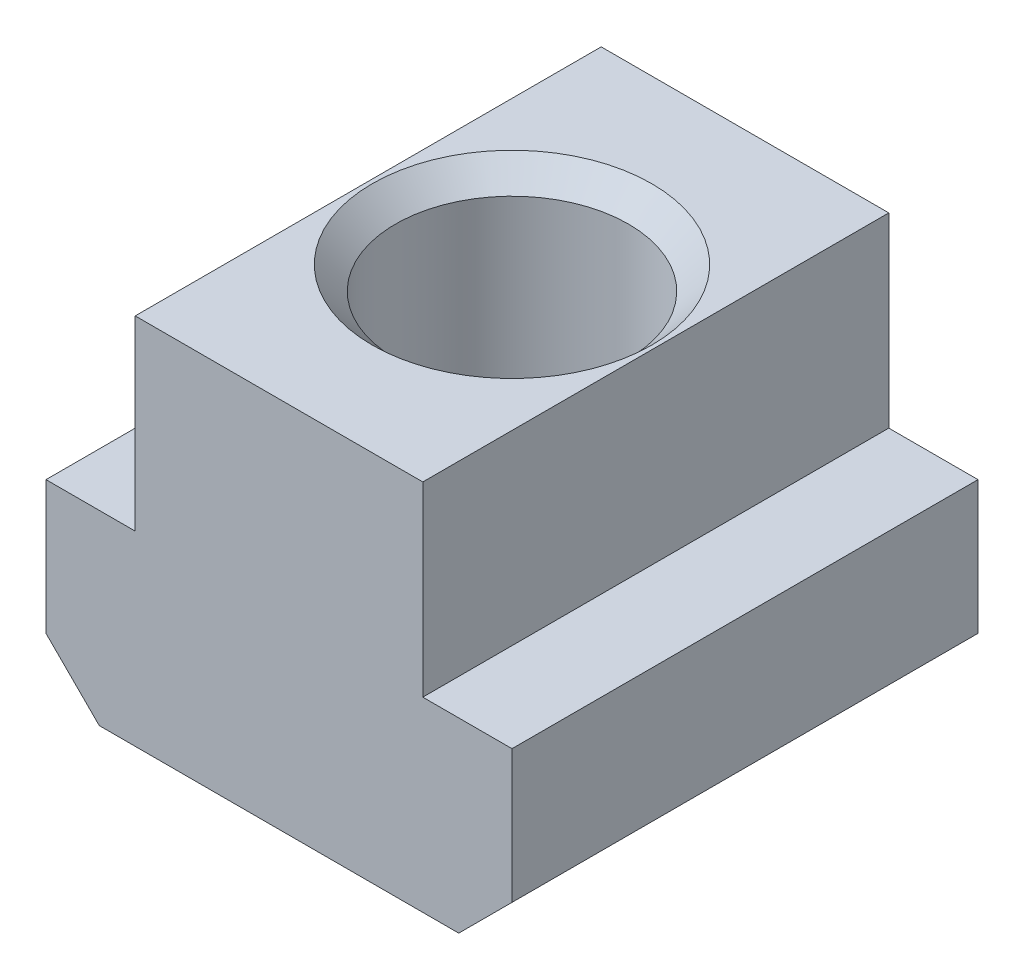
ISO-10303-21;
HEADER;
FILE_DESCRIPTION(('STEP AP214'),'2;1');
FILE_NAME('part.step','',(''),(''),'','','');
FILE_SCHEMA(('AUTOMOTIVE_DESIGN { 1 0 10303 214 1 1 1 1 }'));
ENDSEC;
DATA;
#1=APPLICATION_CONTEXT('core data for automotive mechanical design processes');
#2=APPLICATION_PROTOCOL_DEFINITION('international standard','automotive_design',2000,#1);
#3=PRODUCT_CONTEXT('',#1,'mechanical');
#4=PRODUCT('Part','Part','',(#3));
#5=PRODUCT_RELATED_PRODUCT_CATEGORY('part','',(#4));
#6=PRODUCT_DEFINITION_FORMATION('','',#4);
#7=PRODUCT_DEFINITION_CONTEXT('part definition',#1,'design');
#8=PRODUCT_DEFINITION('design','',#6,#7);
#9=PRODUCT_DEFINITION_SHAPE('','',#8);
#10=(LENGTH_UNIT() NAMED_UNIT(*) SI_UNIT(.MILLI.,.METRE.));
#11=(NAMED_UNIT(*) PLANE_ANGLE_UNIT() SI_UNIT($,.RADIAN.));
#12=(NAMED_UNIT(*) SI_UNIT($,.STERADIAN.) SOLID_ANGLE_UNIT());
#13=UNCERTAINTY_MEASURE_WITH_UNIT(LENGTH_MEASURE(1.E-05),#10,'distance_accuracy_value','');
#14=(GEOMETRIC_REPRESENTATION_CONTEXT(3) GLOBAL_UNCERTAINTY_ASSIGNED_CONTEXT((#13)) GLOBAL_UNIT_ASSIGNED_CONTEXT((#10,
#11,#12)) REPRESENTATION_CONTEXT('',''));
#15=CARTESIAN_POINT('',(0.,0.,0.));
#16=DIRECTION('',(0.,0.,1.));
#17=DIRECTION('',(1.,0.,0.));
#18=AXIS2_PLACEMENT_3D('',#15,#16,#17);
#19=CARTESIAN_POINT('',(17.5,0.,17.5));
#20=DIRECTION('',(-1.,0.,0.));
#21=DIRECTION('',(0.,0.,1.));
#22=AXIS2_PLACEMENT_3D('',#19,#20,#21);
#23=PLANE('',#22);
#24=DIRECTION('',(0.,1.,0.));
#25=VECTOR('',#24,1.);
#26=CARTESIAN_POINT('',(17.5,0.,17.5));
#27=LINE('',#26,#25);
#28=CARTESIAN_POINT('',(17.5,-9.99999999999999,17.5));
#29=VERTEX_POINT('',#28);
#30=CARTESIAN_POINT('',(17.5,0.,17.5));
#31=VERTEX_POINT('',#30);
#32=EDGE_CURVE('E114',#29,#31,#27,.T.);
#33=ORIENTED_EDGE('',*,*,#32,.F.);
#34=DIRECTION('',(0.,0.,-1.));
#35=VECTOR('',#34,1.);
#36=CARTESIAN_POINT('',(17.5,-10.,17.5));
#37=LINE('',#36,#35);
#38=CARTESIAN_POINT('',(17.5,-9.99999999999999,-17.5));
#39=VERTEX_POINT('',#38);
#40=EDGE_CURVE('E11',#29,#39,#37,.T.);
#41=ORIENTED_EDGE('',*,*,#40,.T.);
#42=DIRECTION('',(0.,1.,0.));
#43=VECTOR('',#42,1.);
#44=CARTESIAN_POINT('',(17.5,0.,-17.5));
#45=LINE('',#44,#43);
#46=CARTESIAN_POINT('',(17.5,0.,-17.5));
#47=VERTEX_POINT('',#46);
#48=EDGE_CURVE('E134',#39,#47,#45,.T.);
#49=ORIENTED_EDGE('',*,*,#48,.T.);
#50=DIRECTION('',(0.,0.,-1.));
#51=VECTOR('',#50,1.);
#52=CARTESIAN_POINT('',(17.5,0.,17.5));
#53=LINE('',#52,#51);
#54=EDGE_CURVE('E127',#31,#47,#53,.T.);
#55=ORIENTED_EDGE('',*,*,#54,.F.);
#56=EDGE_LOOP('',(#33,#41,#49,#55));
#57=FACE_BOUND('',#56,.T.);
#58=ADVANCED_FACE('F37',(#57),#23,.F.);
#59=CARTESIAN_POINT('',(10.8,0.,17.5));
#60=DIRECTION('',(0.,-1.,0.));
#61=DIRECTION('',(0.,0.,-1.));
#62=AXIS2_PLACEMENT_3D('',#59,#60,#61);
#63=PLANE('',#62);
#64=DIRECTION('',(-1.,0.,0.));
#65=VECTOR('',#64,1.);
#66=CARTESIAN_POINT('',(10.8,0.,-17.5));
#67=LINE('',#66,#65);
#68=CARTESIAN_POINT('',(10.8,0.,-17.5));
#69=VERTEX_POINT('',#68);
#70=EDGE_CURVE('E200',#47,#69,#67,.T.);
#71=ORIENTED_EDGE('',*,*,#70,.T.);
#72=DIRECTION('',(0.,0.,-1.));
#73=VECTOR('',#72,1.);
#74=CARTESIAN_POINT('',(10.8,0.,17.5));
#75=LINE('',#74,#73);
#76=CARTESIAN_POINT('',(10.8,0.,17.5));
#77=VERTEX_POINT('',#76);
#78=EDGE_CURVE('E129',#77,#69,#75,.T.);
#79=ORIENTED_EDGE('',*,*,#78,.F.);
#80=DIRECTION('',(-1.,0.,0.));
#81=VECTOR('',#80,1.);
#82=CARTESIAN_POINT('',(10.8,0.,17.5));
#83=LINE('',#82,#81);
#84=EDGE_CURVE('E117',#31,#77,#83,.T.);
#85=ORIENTED_EDGE('',*,*,#84,.F.);
#86=ORIENTED_EDGE('',*,*,#54,.T.);
#87=EDGE_LOOP('',(#71,#79,#85,#86));
#88=FACE_BOUND('',#87,.T.);
#89=ADVANCED_FACE('F126',(#88),#63,.F.);
#90=CARTESIAN_POINT('',(10.8,14.,17.5));
#91=DIRECTION('',(-1.,0.,0.));
#92=DIRECTION('',(0.,-1.,0.));
#93=AXIS2_PLACEMENT_3D('',#90,#91,#92);
#94=PLANE('',#93);
#95=DIRECTION('',(0.,1.,0.));
#96=VECTOR('',#95,1.);
#97=CARTESIAN_POINT('',(10.8,14.,-17.5));
#98=LINE('',#97,#96);
#99=CARTESIAN_POINT('',(10.8,14.,-17.5));
#100=VERTEX_POINT('',#99);
#101=EDGE_CURVE('E198',#69,#100,#98,.T.);
#102=ORIENTED_EDGE('',*,*,#101,.T.);
#103=DIRECTION('',(0.,0.,-1.));
#104=VECTOR('',#103,1.);
#105=CARTESIAN_POINT('',(10.8,14.,17.5));
#106=LINE('',#105,#104);
#107=CARTESIAN_POINT('',(10.8,14.,17.5));
#108=VERTEX_POINT('',#107);
#109=EDGE_CURVE('E140',#108,#100,#106,.T.);
#110=ORIENTED_EDGE('',*,*,#109,.F.);
#111=DIRECTION('',(0.,1.,0.));
#112=VECTOR('',#111,1.);
#113=CARTESIAN_POINT('',(10.8,14.,17.5));
#114=LINE('',#113,#112);
#115=EDGE_CURVE('E131',#77,#108,#114,.T.);
#116=ORIENTED_EDGE('',*,*,#115,.F.);
#117=ORIENTED_EDGE('',*,*,#78,.T.);
#118=EDGE_LOOP('',(#102,#110,#116,#117));
#119=FACE_BOUND('',#118,.T.);
#120=ADVANCED_FACE('F226',(#119),#94,.F.);
#121=CARTESIAN_POINT('',(-10.8,14.,17.5));
#122=DIRECTION('',(0.,-1.,0.));
#123=DIRECTION('',(0.,0.,-1.));
#124=AXIS2_PLACEMENT_3D('',#121,#122,#123);
#125=PLANE('',#124);
#126=CARTESIAN_POINT('',(0.,14.,0.));
#127=DIRECTION('',(0.,1.,0.));
#128=DIRECTION('',(0.,0.,1.));
#129=AXIS2_PLACEMENT_3D('',#126,#127,#128);
#130=CIRCLE('',#129,10.5);
#131=CARTESIAN_POINT('',(0.,14.,10.5));
#132=VERTEX_POINT('',#131);
#133=EDGE_CURVE('E218',#132,#132,#130,.T.);
#134=ORIENTED_EDGE('',*,*,#133,.F.);
#135=EDGE_LOOP('',(#134));
#136=FACE_BOUND('',#135,.T.);
#137=DIRECTION('',(-1.,0.,0.));
#138=VECTOR('',#137,1.);
#139=CARTESIAN_POINT('',(-10.8,14.,-17.5));
#140=LINE('',#139,#138);
#141=CARTESIAN_POINT('',(-10.8,14.,-17.5));
#142=VERTEX_POINT('',#141);
#143=EDGE_CURVE('E193',#100,#142,#140,.T.);
#144=ORIENTED_EDGE('',*,*,#143,.T.);
#145=DIRECTION('',(0.,0.,-1.));
#146=VECTOR('',#145,1.);
#147=CARTESIAN_POINT('',(-10.8,14.,17.5));
#148=LINE('',#147,#146);
#149=CARTESIAN_POINT('',(-10.8,14.,17.5));
#150=VERTEX_POINT('',#149);
#151=EDGE_CURVE('E184',#150,#142,#148,.T.);
#152=ORIENTED_EDGE('',*,*,#151,.F.);
#153=DIRECTION('',(-1.,0.,0.));
#154=VECTOR('',#153,1.);
#155=CARTESIAN_POINT('',(-10.8,14.,17.5));
#156=LINE('',#155,#154);
#157=EDGE_CURVE('E194',#108,#150,#156,.T.);
#158=ORIENTED_EDGE('',*,*,#157,.F.);
#159=ORIENTED_EDGE('',*,*,#109,.T.);
#160=EDGE_LOOP('',(#144,#152,#158,#159));
#161=FACE_BOUND('',#160,.T.);
#162=ADVANCED_FACE('F191',(#136,#161),#125,.F.);
#163=CARTESIAN_POINT('',(-10.8,14.,17.5));
#164=DIRECTION('',(1.,0.,0.));
#165=DIRECTION('',(0.,1.,0.));
#166=AXIS2_PLACEMENT_3D('',#163,#164,#165);
#167=PLANE('',#166);
#168=DIRECTION('',(0.,-1.,0.));
#169=VECTOR('',#168,1.);
#170=CARTESIAN_POINT('',(-10.8,14.,-17.5));
#171=LINE('',#170,#169);
#172=CARTESIAN_POINT('',(-10.8,0.,-17.5));
#173=VERTEX_POINT('',#172);
#174=EDGE_CURVE('E176',#142,#173,#171,.T.);
#175=ORIENTED_EDGE('',*,*,#174,.T.);
#176=DIRECTION('',(0.,0.,-1.));
#177=VECTOR('',#176,1.);
#178=CARTESIAN_POINT('',(-10.8,0.,17.5));
#179=LINE('',#178,#177);
#180=CARTESIAN_POINT('',(-10.8,0.,17.5));
#181=VERTEX_POINT('',#180);
#182=EDGE_CURVE('E181',#181,#173,#179,.T.);
#183=ORIENTED_EDGE('',*,*,#182,.F.);
#184=DIRECTION('',(0.,-1.,0.));
#185=VECTOR('',#184,1.);
#186=CARTESIAN_POINT('',(-10.8,14.,17.5));
#187=LINE('',#186,#185);
#188=EDGE_CURVE('E209',#150,#181,#187,.T.);
#189=ORIENTED_EDGE('',*,*,#188,.F.);
#190=ORIENTED_EDGE('',*,*,#151,.T.);
#191=EDGE_LOOP('',(#175,#183,#189,#190));
#192=FACE_BOUND('',#191,.T.);
#193=ADVANCED_FACE('F225',(#192),#167,.F.);
#194=CARTESIAN_POINT('',(-17.5,0.,17.5));
#195=DIRECTION('',(0.,-1.,0.));
#196=DIRECTION('',(0.,0.,-1.));
#197=AXIS2_PLACEMENT_3D('',#194,#195,#196);
#198=PLANE('',#197);
#199=DIRECTION('',(-1.,0.,0.));
#200=VECTOR('',#199,1.);
#201=CARTESIAN_POINT('',(-17.5,0.,-17.5));
#202=LINE('',#201,#200);
#203=CARTESIAN_POINT('',(-17.5,0.,-17.5));
#204=VERTEX_POINT('',#203);
#205=EDGE_CURVE('E173',#173,#204,#202,.T.);
#206=ORIENTED_EDGE('',*,*,#205,.T.);
#207=DIRECTION('',(0.,0.,-1.));
#208=VECTOR('',#207,1.);
#209=CARTESIAN_POINT('',(-17.5,0.,17.5));
#210=LINE('',#209,#208);
#211=CARTESIAN_POINT('',(-17.5,0.,17.5));
#212=VERTEX_POINT('',#211);
#213=EDGE_CURVE('E162',#212,#204,#210,.T.);
#214=ORIENTED_EDGE('',*,*,#213,.F.);
#215=DIRECTION('',(-1.,0.,0.));
#216=VECTOR('',#215,1.);
#217=CARTESIAN_POINT('',(-17.5,0.,17.5));
#218=LINE('',#217,#216);
#219=EDGE_CURVE('E207',#181,#212,#218,.T.);
#220=ORIENTED_EDGE('',*,*,#219,.F.);
#221=ORIENTED_EDGE('',*,*,#182,.T.);
#222=EDGE_LOOP('',(#206,#214,#220,#221));
#223=FACE_BOUND('',#222,.T.);
#224=ADVANCED_FACE('F232',(#223),#198,.F.);
#225=CARTESIAN_POINT('',(-17.5,0.,17.5));
#226=DIRECTION('',(1.,0.,0.));
#227=DIRECTION('',(0.,0.,-1.));
#228=AXIS2_PLACEMENT_3D('',#225,#226,#227);
#229=PLANE('',#228);
#230=DIRECTION('',(0.,-1.,0.));
#231=VECTOR('',#230,1.);
#232=CARTESIAN_POINT('',(-17.5,0.,-17.5));
#233=LINE('',#232,#231);
#234=CARTESIAN_POINT('',(-17.5,-10.,-17.5));
#235=VERTEX_POINT('',#234);
#236=EDGE_CURVE('E169',#204,#235,#233,.T.);
#237=ORIENTED_EDGE('',*,*,#236,.T.);
#238=DIRECTION('',(0.,0.,1.));
#239=VECTOR('',#238,1.);
#240=CARTESIAN_POINT('',(-17.5,-10.,17.5));
#241=LINE('',#240,#239);
#242=CARTESIAN_POINT('',(-17.5,-10.,17.5));
#243=VERTEX_POINT('',#242);
#244=EDGE_CURVE('E60',#235,#243,#241,.T.);
#245=ORIENTED_EDGE('',*,*,#244,.T.);
#246=DIRECTION('',(0.,-1.,0.));
#247=VECTOR('',#246,1.);
#248=CARTESIAN_POINT('',(-17.5,0.,17.5));
#249=LINE('',#248,#247);
#250=EDGE_CURVE('E154',#212,#243,#249,.T.);
#251=ORIENTED_EDGE('',*,*,#250,.F.);
#252=ORIENTED_EDGE('',*,*,#213,.T.);
#253=EDGE_LOOP('',(#237,#245,#251,#252));
#254=FACE_BOUND('',#253,.T.);
#255=ADVANCED_FACE('F171',(#254),#229,.F.);
#256=CARTESIAN_POINT('',(-17.5,-14.,17.5));
#257=DIRECTION('',(0.,1.,0.));
#258=DIRECTION('',(0.,0.,1.));
#259=AXIS2_PLACEMENT_3D('',#256,#257,#258);
#260=PLANE('',#259);
#261=CARTESIAN_POINT('',(0.,-14.,0.));
#262=DIRECTION('',(0.,1.,0.));
#263=DIRECTION('',(0.,0.,1.));
#264=AXIS2_PLACEMENT_3D('',#261,#262,#263);
#265=CIRCLE('',#264,8.74999999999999);
#266=CARTESIAN_POINT('',(0.,-14.,8.74999999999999));
#267=VERTEX_POINT('',#266);
#268=EDGE_CURVE('E204',#267,#267,#265,.T.);
#269=ORIENTED_EDGE('',*,*,#268,.T.);
#270=EDGE_LOOP('',(#269));
#271=FACE_BOUND('',#270,.T.);
#272=DIRECTION('',(1.,0.,0.));
#273=VECTOR('',#272,1.);
#274=CARTESIAN_POINT('',(-17.5,-14.,17.5));
#275=LINE('',#274,#273);
#276=CARTESIAN_POINT('',(-13.5,-14.,17.5));
#277=VERTEX_POINT('',#276);
#278=CARTESIAN_POINT('',(13.5,-14.,17.5));
#279=VERTEX_POINT('',#278);
#280=EDGE_CURVE('E153',#277,#279,#275,.T.);
#281=ORIENTED_EDGE('',*,*,#280,.F.);
#282=DIRECTION('',(0.,0.,-1.));
#283=VECTOR('',#282,1.);
#284=CARTESIAN_POINT('',(-13.5,-14.,17.5));
#285=LINE('',#284,#283);
#286=CARTESIAN_POINT('',(-13.5,-14.,-17.5));
#287=VERTEX_POINT('',#286);
#288=EDGE_CURVE('E138',#277,#287,#285,.T.);
#289=ORIENTED_EDGE('',*,*,#288,.T.);
#290=DIRECTION('',(1.,0.,0.));
#291=VECTOR('',#290,1.);
#292=CARTESIAN_POINT('',(-17.5,-14.,-17.5));
#293=LINE('',#292,#291);
#294=CARTESIAN_POINT('',(13.5,-14.,-17.5));
#295=VERTEX_POINT('',#294);
#296=EDGE_CURVE('E122',#287,#295,#293,.T.);
#297=ORIENTED_EDGE('',*,*,#296,.T.);
#298=DIRECTION('',(0.,0.,1.));
#299=VECTOR('',#298,1.);
#300=CARTESIAN_POINT('',(13.5,-14.,17.5));
#301=LINE('',#300,#299);
#302=EDGE_CURVE('E136',#295,#279,#301,.T.);
#303=ORIENTED_EDGE('',*,*,#302,.T.);
#304=EDGE_LOOP('',(#281,#289,#297,#303));
#305=FACE_BOUND('',#304,.T.);
#306=ADVANCED_FACE('F158',(#271,#305),#260,.F.);
#307=CARTESIAN_POINT('',(0.,0.,17.5));
#308=DIRECTION('',(0.,0.,1.));
#309=DIRECTION('',(1.,0.,0.));
#310=AXIS2_PLACEMENT_3D('',#307,#308,#309);
#311=PLANE('',#310);
#312=ORIENTED_EDGE('',*,*,#250,.T.);
#313=DIRECTION('',(-0.707106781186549,0.707106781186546,0.));
#314=VECTOR('',#313,1.);
#315=CARTESIAN_POINT('',(-13.75,-13.75,17.5));
#316=LINE('',#315,#314);
#317=EDGE_CURVE('E45',#243,#277,#316,.F.);
#318=ORIENTED_EDGE('',*,*,#317,.T.);
#319=ORIENTED_EDGE('',*,*,#280,.T.);
#320=DIRECTION('',(-0.707106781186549,-0.707106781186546,0.));
#321=VECTOR('',#320,1.);
#322=CARTESIAN_POINT('',(13.75,-13.75,17.5));
#323=LINE('',#322,#321);
#324=EDGE_CURVE('E52',#279,#29,#323,.F.);
#325=ORIENTED_EDGE('',*,*,#324,.T.);
#326=ORIENTED_EDGE('',*,*,#32,.T.);
#327=ORIENTED_EDGE('',*,*,#84,.T.);
#328=ORIENTED_EDGE('',*,*,#115,.T.);
#329=ORIENTED_EDGE('',*,*,#157,.T.);
#330=ORIENTED_EDGE('',*,*,#188,.T.);
#331=ORIENTED_EDGE('',*,*,#219,.T.);
#332=EDGE_LOOP('',(#312,#318,#319,#325,#326,#327,#328,#329,#330,#331));
#333=FACE_BOUND('',#332,.T.);
#334=ADVANCED_FACE('F116',(#333),#311,.T.);
#335=CARTESIAN_POINT('',(0.,0.,-17.5));
#336=DIRECTION('',(0.,0.,1.));
#337=DIRECTION('',(1.,0.,0.));
#338=AXIS2_PLACEMENT_3D('',#335,#336,#337);
#339=PLANE('',#338);
#340=ORIENTED_EDGE('',*,*,#296,.F.);
#341=DIRECTION('',(0.707106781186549,-0.707106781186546,0.));
#342=VECTOR('',#341,1.);
#343=CARTESIAN_POINT('',(-13.5,-14.,-17.5));
#344=LINE('',#343,#342);
#345=EDGE_CURVE('E148',#287,#235,#344,.F.);
#346=ORIENTED_EDGE('',*,*,#345,.T.);
#347=ORIENTED_EDGE('',*,*,#236,.F.);
#348=ORIENTED_EDGE('',*,*,#205,.F.);
#349=ORIENTED_EDGE('',*,*,#174,.F.);
#350=ORIENTED_EDGE('',*,*,#143,.F.);
#351=ORIENTED_EDGE('',*,*,#101,.F.);
#352=ORIENTED_EDGE('',*,*,#70,.F.);
#353=ORIENTED_EDGE('',*,*,#48,.F.);
#354=DIRECTION('',(0.707106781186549,0.707106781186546,0.));
#355=VECTOR('',#354,1.);
#356=CARTESIAN_POINT('',(17.5,-10.,-17.5));
#357=LINE('',#356,#355);
#358=EDGE_CURVE('E146',#39,#295,#357,.F.);
#359=ORIENTED_EDGE('',*,*,#358,.T.);
#360=EDGE_LOOP('',(#340,#346,#347,#348,#349,#350,#351,#352,#353,#359));
#361=FACE_BOUND('',#360,.T.);
#362=ADVANCED_FACE('F167',(#361),#339,.F.);
#363=CARTESIAN_POINT('',(0.,14.,0.));
#364=DIRECTION('',(0.,1.,0.));
#365=DIRECTION('',(0.,0.,1.));
#366=AXIS2_PLACEMENT_3D('',#363,#364,#365);
#367=CYLINDRICAL_SURFACE('',#366,8.74999999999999);
#368=ORIENTED_EDGE('',*,*,#268,.F.);
#369=EDGE_LOOP('',(#368));
#370=FACE_BOUND('',#369,.T.);
#371=CARTESIAN_POINT('',(0.,12.25,0.));
#372=DIRECTION('',(0.,1.,0.));
#373=DIRECTION('',(0.,0.,1.));
#374=AXIS2_PLACEMENT_3D('',#371,#372,#373);
#375=CIRCLE('',#374,8.74999999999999);
#376=CARTESIAN_POINT('',(0.,12.25,8.74999999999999));
#377=VERTEX_POINT('',#376);
#378=EDGE_CURVE('E215',#377,#377,#375,.T.);
#379=ORIENTED_EDGE('',*,*,#378,.T.);
#380=EDGE_LOOP('',(#379));
#381=FACE_BOUND('',#380,.T.);
#382=ADVANCED_FACE('F248',(#370,#381),#367,.F.);
#383=CARTESIAN_POINT('',(0.,14.,0.));
#384=DIRECTION('',(0.,1.,0.));
#385=DIRECTION('',(0.,0.,1.));
#386=AXIS2_PLACEMENT_3D('',#383,#384,#385);
#387=CONICAL_SURFACE('',#386,10.5,0.78539816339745);
#388=ORIENTED_EDGE('',*,*,#378,.F.);
#389=EDGE_LOOP('',(#388));
#390=FACE_BOUND('',#389,.T.);
#391=ORIENTED_EDGE('',*,*,#133,.T.);
#392=EDGE_LOOP('',(#391));
#393=FACE_BOUND('',#392,.T.);
#394=ADVANCED_FACE('F222',(#390,#393),#387,.F.);
#395=CARTESIAN_POINT('',(-13.5,-14.,17.5));
#396=DIRECTION('',(0.707106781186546,0.707106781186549,0.));
#397=DIRECTION('',(0.,0.,-1.));
#398=AXIS2_PLACEMENT_3D('',#395,#396,#397);
#399=PLANE('',#398);
#400=ORIENTED_EDGE('',*,*,#317,.F.);
#401=ORIENTED_EDGE('',*,*,#244,.F.);
#402=ORIENTED_EDGE('',*,*,#345,.F.);
#403=ORIENTED_EDGE('',*,*,#288,.F.);
#404=EDGE_LOOP('',(#400,#401,#402,#403));
#405=FACE_BOUND('',#404,.T.);
#406=ADVANCED_FACE('F164',(#405),#399,.F.);
#407=CARTESIAN_POINT('',(17.5,-10.,17.5));
#408=DIRECTION('',(-0.707106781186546,0.707106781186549,0.));
#409=DIRECTION('',(0.,0.,-1.));
#410=AXIS2_PLACEMENT_3D('',#407,#408,#409);
#411=PLANE('',#410);
#412=ORIENTED_EDGE('',*,*,#324,.F.);
#413=ORIENTED_EDGE('',*,*,#302,.F.);
#414=ORIENTED_EDGE('',*,*,#358,.F.);
#415=ORIENTED_EDGE('',*,*,#40,.F.);
#416=EDGE_LOOP('',(#412,#413,#414,#415));
#417=FACE_BOUND('',#416,.T.);
#418=ADVANCED_FACE('F39',(#417),#411,.F.);
#419=CLOSED_SHELL('',(#58,#89,#120,#162,#193,#224,#255,#306,#334,#362,#382,#394,#406,#418));
#420=MANIFOLD_SOLID_BREP('B2',#419);
#421=ADVANCED_BREP_SHAPE_REPRESENTATION('',(#18,#420),#14);
#422=SHAPE_DEFINITION_REPRESENTATION(#9,#421);
ENDSEC;
END-ISO-10303-21;
